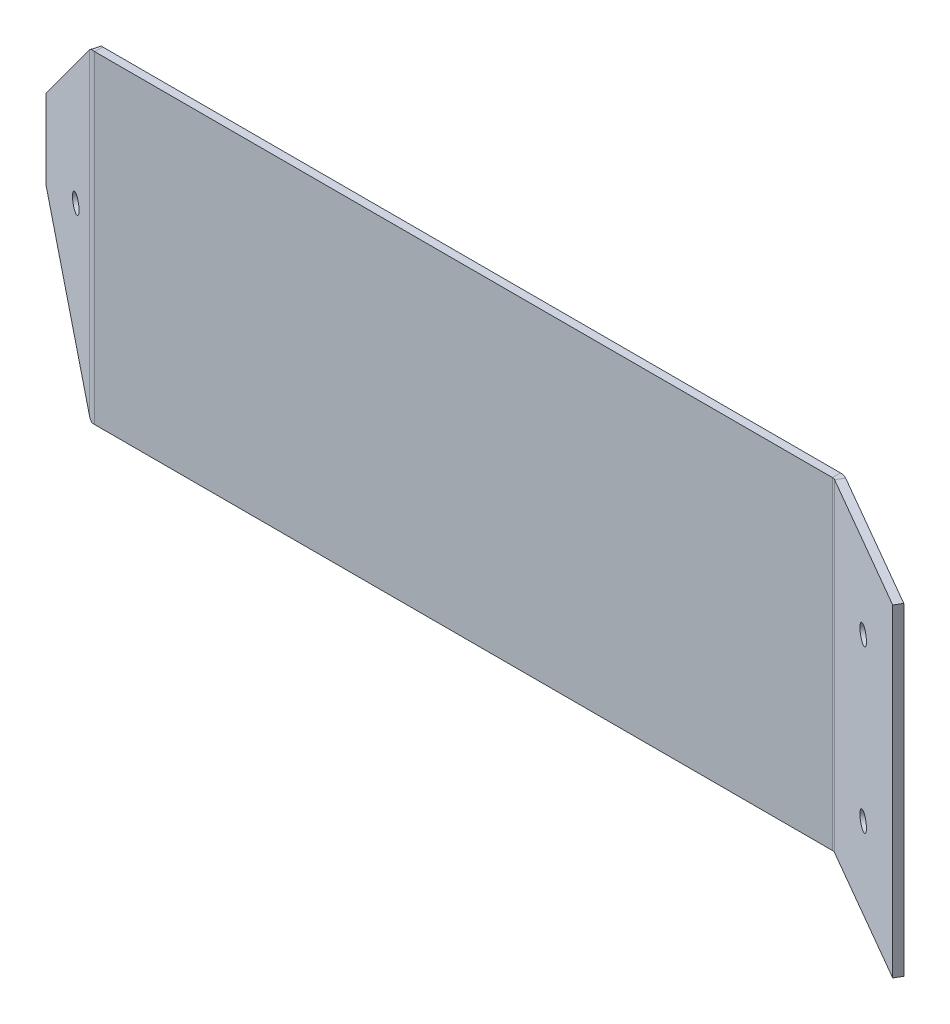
ISO-10303-21;
HEADER;
FILE_DESCRIPTION(('STEP AP214'),'2;1');
FILE_NAME('part.step','',(''),(''),'','','');
FILE_SCHEMA(('AUTOMOTIVE_DESIGN { 1 0 10303 214 1 1 1 1 }'));
ENDSEC;
DATA;
#1=APPLICATION_CONTEXT('core data for automotive mechanical design processes');
#2=APPLICATION_PROTOCOL_DEFINITION('international standard','automotive_design',2000,#1);
#3=PRODUCT_CONTEXT('',#1,'mechanical');
#4=PRODUCT('Part','Part','',(#3));
#5=PRODUCT_RELATED_PRODUCT_CATEGORY('part','',(#4));
#6=PRODUCT_DEFINITION_FORMATION('','',#4);
#7=PRODUCT_DEFINITION_CONTEXT('part definition',#1,'design');
#8=PRODUCT_DEFINITION('design','',#6,#7);
#9=PRODUCT_DEFINITION_SHAPE('','',#8);
#10=(LENGTH_UNIT() NAMED_UNIT(*) SI_UNIT(.MILLI.,.METRE.));
#11=(NAMED_UNIT(*) PLANE_ANGLE_UNIT() SI_UNIT($,.RADIAN.));
#12=(NAMED_UNIT(*) SI_UNIT($,.STERADIAN.) SOLID_ANGLE_UNIT());
#13=UNCERTAINTY_MEASURE_WITH_UNIT(LENGTH_MEASURE(1.E-05),#10,'distance_accuracy_value','');
#14=(GEOMETRIC_REPRESENTATION_CONTEXT(3) GLOBAL_UNCERTAINTY_ASSIGNED_CONTEXT((#13)) GLOBAL_UNIT_ASSIGNED_CONTEXT((#10,
#11,#12)) REPRESENTATION_CONTEXT('',''));
#15=CARTESIAN_POINT('',(0.,0.,0.));
#16=DIRECTION('',(0.,0.,1.));
#17=DIRECTION('',(1.,0.,0.));
#18=AXIS2_PLACEMENT_3D('',#15,#16,#17);
#19=CARTESIAN_POINT('',(-150.,-19.9999999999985,1.));
#20=DIRECTION('',(0.,1.,0.));
#21=DIRECTION('',(-1.,0.,0.));
#22=AXIS2_PLACEMENT_3D('',#19,#20,#21);
#23=PLANE('',#22);
#24=DIRECTION('',(1.,0.,0.));
#25=VECTOR('',#24,1.);
#26=CARTESIAN_POINT('',(-150.,-19.9999999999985,1.));
#27=LINE('',#26,#25);
#28=CARTESIAN_POINT('',(-149.676258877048,-19.9999999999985,1.00000010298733));
#29=VERTEX_POINT('',#28);
#30=CARTESIAN_POINT('',(-58.3237411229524,-19.9999999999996,1.));
#31=VERTEX_POINT('',#30);
#32=EDGE_CURVE('E343',#29,#31,#27,.T.);
#33=ORIENTED_EDGE('',*,*,#32,.F.);
#34=DIRECTION('',(0.,0.,-1.));
#35=VECTOR('',#34,1.);
#36=CARTESIAN_POINT('',(-149.676258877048,-19.9999999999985,1.));
#37=LINE('',#36,#35);
#38=CARTESIAN_POINT('',(-149.676258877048,-19.9999999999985,0.));
#39=VERTEX_POINT('',#38);
#40=EDGE_CURVE('E12',#29,#39,#37,.T.);
#41=ORIENTED_EDGE('',*,*,#40,.T.);
#42=DIRECTION('',(1.,0.,0.));
#43=VECTOR('',#42,1.);
#44=CARTESIAN_POINT('',(-150.,-19.9999999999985,0.));
#45=LINE('',#44,#43);
#46=CARTESIAN_POINT('',(-58.3237411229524,-19.9999999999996,0.));
#47=VERTEX_POINT('',#46);
#48=EDGE_CURVE('E356',#39,#47,#45,.T.);
#49=ORIENTED_EDGE('',*,*,#48,.T.);
#50=DIRECTION('',(0.,0.,-1.));
#51=VECTOR('',#50,1.);
#52=CARTESIAN_POINT('',(-58.3237411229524,-19.9999999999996,1.));
#53=LINE('',#52,#51);
#54=EDGE_CURVE('E338',#31,#47,#53,.T.);
#55=ORIENTED_EDGE('',*,*,#54,.F.);
#56=EDGE_LOOP('',(#33,#41,#49,#55));
#57=FACE_BOUND('',#56,.T.);
#58=ADVANCED_FACE('F50',(#57),#23,.F.);
#59=CARTESIAN_POINT('',(-38.,20.0000000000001,0.));
#60=DIRECTION('',(0.,0.,1.));
#61=DIRECTION('',(1.,0.,0.));
#62=AXIS2_PLACEMENT_3D('',#59,#60,#61);
#63=PLANE('',#62);
#64=ORIENTED_EDGE('',*,*,#48,.F.);
#65=DIRECTION('',(0.,1.,0.));
#66=VECTOR('',#65,1.);
#67=CARTESIAN_POINT('',(-149.676258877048,20.0000000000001,0.));
#68=LINE('',#67,#66);
#69=CARTESIAN_POINT('',(-149.676258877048,20.0000000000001,1.04772340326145E-07));
#70=VERTEX_POINT('',#69);
#71=EDGE_CURVE('E61',#39,#70,#68,.T.);
#72=ORIENTED_EDGE('',*,*,#71,.T.);
#73=DIRECTION('',(-1.,0.,0.));
#74=VECTOR('',#73,1.);
#75=CARTESIAN_POINT('',(-150.,20.0000000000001,0.));
#76=LINE('',#75,#74);
#77=CARTESIAN_POINT('',(-58.3237411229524,20.0000000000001,0.));
#78=VERTEX_POINT('',#77);
#79=EDGE_CURVE('E402',#78,#70,#76,.T.);
#80=ORIENTED_EDGE('',*,*,#79,.F.);
#81=DIRECTION('',(0.,1.,0.));
#82=VECTOR('',#81,1.);
#83=CARTESIAN_POINT('',(-58.3237411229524,20.0000000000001,0.));
#84=LINE('',#83,#82);
#85=EDGE_CURVE('E347',#47,#78,#84,.T.);
#86=ORIENTED_EDGE('',*,*,#85,.F.);
#87=EDGE_LOOP('',(#64,#72,#80,#86));
#88=FACE_BOUND('',#87,.T.);
#89=ADVANCED_FACE('F52',(#88),#63,.F.);
#90=CARTESIAN_POINT('',(-150.,20.0000000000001,1.));
#91=DIRECTION('',(0.,-1.,0.));
#92=DIRECTION('',(1.,0.,0.));
#93=AXIS2_PLACEMENT_3D('',#90,#91,#92);
#94=PLANE('',#93);
#95=ORIENTED_EDGE('',*,*,#79,.T.);
#96=DIRECTION('',(0.,0.,1.));
#97=VECTOR('',#96,1.);
#98=CARTESIAN_POINT('',(-149.676258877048,20.0000000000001,1.));
#99=LINE('',#98,#97);
#100=CARTESIAN_POINT('',(-149.676258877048,20.0000000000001,1.00000010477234));
#101=VERTEX_POINT('',#100);
#102=EDGE_CURVE('E396',#70,#101,#99,.T.);
#103=ORIENTED_EDGE('',*,*,#102,.T.);
#104=DIRECTION('',(-1.,0.,0.));
#105=VECTOR('',#104,1.);
#106=CARTESIAN_POINT('',(-150.,20.0000000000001,1.));
#107=LINE('',#106,#105);
#108=CARTESIAN_POINT('',(-58.3237411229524,20.0000000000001,1.00000004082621));
#109=VERTEX_POINT('',#108);
#110=EDGE_CURVE('E342',#109,#101,#107,.T.);
#111=ORIENTED_EDGE('',*,*,#110,.F.);
#112=DIRECTION('',(0.,0.,1.));
#113=VECTOR('',#112,1.);
#114=CARTESIAN_POINT('',(-58.3237411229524,20.0000000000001,1.));
#115=LINE('',#114,#113);
#116=EDGE_CURVE('E344',#78,#109,#115,.T.);
#117=ORIENTED_EDGE('',*,*,#116,.F.);
#118=EDGE_LOOP('',(#95,#103,#111,#117));
#119=FACE_BOUND('',#118,.T.);
#120=ADVANCED_FACE('F451',(#119),#94,.F.);
#121=CARTESIAN_POINT('',(-40.4153010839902,20.0000000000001,10.0707897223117));
#122=DIRECTION('',(-0.500000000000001,0.,0.866025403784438));
#123=DIRECTION('',(0.866025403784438,0.,0.500000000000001));
#124=AXIS2_PLACEMENT_3D('',#121,#122,#123);
#125=PLANE('',#124);
#126=CARTESIAN_POINT('',(-49.0755551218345,10.0000000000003,5.07078972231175));
#127=DIRECTION('',(-0.500000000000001,0.,0.866025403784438));
#128=DIRECTION('',(0.866025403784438,0.,0.500000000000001));
#129=AXIS2_PLACEMENT_3D('',#126,#127,#128);
#130=CIRCLE('',#129,1.1);
#131=CARTESIAN_POINT('',(-48.1229271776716,10.0000000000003,5.62078972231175));
#132=VERTEX_POINT('',#131);
#133=EDGE_CURVE('E362',#132,#132,#130,.T.);
#134=ORIENTED_EDGE('',*,*,#133,.T.);
#135=EDGE_LOOP('',(#134));
#136=FACE_BOUND('',#135,.T.);
#137=CARTESIAN_POINT('',(-49.0755551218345,-9.99999999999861,5.07078972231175));
#138=DIRECTION('',(-0.500000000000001,0.,0.866025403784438));
#139=DIRECTION('',(-0.866025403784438,0.,-0.500000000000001));
#140=AXIS2_PLACEMENT_3D('',#137,#138,#139);
#141=CIRCLE('',#140,1.10000000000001);
#142=CARTESIAN_POINT('',(-50.0281830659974,-9.99999999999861,4.52078972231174));
#143=VERTEX_POINT('',#142);
#144=EDGE_CURVE('E355',#143,#143,#141,.T.);
#145=ORIENTED_EDGE('',*,*,#144,.T.);
#146=EDGE_LOOP('',(#145));
#147=FACE_BOUND('',#146,.T.);
#148=DIRECTION('',(0.866025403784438,0.,0.500000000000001));
#149=VECTOR('',#148,1.);
#150=CARTESIAN_POINT('',(-137.410146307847,-19.9999999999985,-45.9292102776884));
#151=LINE('',#150,#149);
#152=CARTESIAN_POINT('',(-57.4554411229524,-19.9999999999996,0.232660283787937));
#153=VERTEX_POINT('',#152);
#154=CARTESIAN_POINT('',(-40.4153010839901,-19.9999999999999,10.0707897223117));
#155=VERTEX_POINT('',#154);
#156=EDGE_CURVE('E77',#153,#155,#151,.T.);
#157=ORIENTED_EDGE('',*,*,#156,.F.);
#158=DIRECTION('',(0.,1.,0.));
#159=VECTOR('',#158,1.);
#160=CARTESIAN_POINT('',(-57.4554411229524,20.0000000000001,0.232660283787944));
#161=LINE('',#160,#159);
#162=CARTESIAN_POINT('',(-57.4554411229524,20.0000000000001,0.232660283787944));
#163=VERTEX_POINT('',#162);
#164=EDGE_CURVE('E385',#153,#163,#161,.T.);
#165=ORIENTED_EDGE('',*,*,#164,.T.);
#166=DIRECTION('',(-0.866025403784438,0.,-0.500000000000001));
#167=VECTOR('',#166,1.);
#168=CARTESIAN_POINT('',(-137.410146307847,20.0000000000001,-45.9292102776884));
#169=LINE('',#168,#167);
#170=CARTESIAN_POINT('',(-40.4153010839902,20.0000000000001,10.0707897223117));
#171=VERTEX_POINT('',#170);
#172=EDGE_CURVE('E368',#171,#163,#169,.T.);
#173=ORIENTED_EDGE('',*,*,#172,.F.);
#174=DIRECTION('',(0.,1.,0.));
#175=VECTOR('',#174,1.);
#176=CARTESIAN_POINT('',(-40.4153010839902,20.0000000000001,10.0707897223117));
#177=LINE('',#176,#175);
#178=EDGE_CURVE('E365',#155,#171,#177,.T.);
#179=ORIENTED_EDGE('',*,*,#178,.F.);
#180=EDGE_LOOP('',(#157,#165,#173,#179));
#181=FACE_BOUND('',#180,.T.);
#182=ADVANCED_FACE('F493',(#136,#147,#181),#125,.F.);
#183=CARTESIAN_POINT('',(-137.910146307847,-19.9999999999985,-45.063184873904));
#184=DIRECTION('',(0.,1.,0.));
#185=DIRECTION('',(-0.866025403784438,0.,-0.500000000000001));
#186=AXIS2_PLACEMENT_3D('',#183,#184,#185);
#187=PLANE('',#186);
#188=DIRECTION('',(0.866025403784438,0.,0.500000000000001));
#189=VECTOR('',#188,1.);
#190=CARTESIAN_POINT('',(-137.910146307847,-19.9999999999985,-45.063184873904));
#191=LINE('',#190,#189);
#192=CARTESIAN_POINT('',(-57.9554411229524,-19.9999999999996,1.09868568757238));
#193=VERTEX_POINT('',#192);
#194=CARTESIAN_POINT('',(-40.9153010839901,-19.9999999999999,10.9368151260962));
#195=VERTEX_POINT('',#194);
#196=EDGE_CURVE('E377',#193,#195,#191,.T.);
#197=ORIENTED_EDGE('',*,*,#196,.F.);
#198=DIRECTION('',(0.500000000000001,0.,-0.866025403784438));
#199=VECTOR('',#198,1.);
#200=CARTESIAN_POINT('',(-57.9554411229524,-19.9999999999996,1.09868568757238));
#201=LINE('',#200,#199);
#202=EDGE_CURVE('E387',#193,#153,#201,.T.);
#203=ORIENTED_EDGE('',*,*,#202,.T.);
#204=ORIENTED_EDGE('',*,*,#156,.T.);
#205=DIRECTION('',(0.500000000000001,0.,-0.866025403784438));
#206=VECTOR('',#205,1.);
#207=CARTESIAN_POINT('',(-40.9153010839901,-19.9999999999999,10.9368151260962));
#208=LINE('',#207,#206);
#209=EDGE_CURVE('E373',#195,#155,#208,.T.);
#210=ORIENTED_EDGE('',*,*,#209,.F.);
#211=EDGE_LOOP('',(#197,#203,#204,#210));
#212=FACE_BOUND('',#211,.T.);
#213=ADVANCED_FACE('F488',(#212),#187,.F.);
#214=CARTESIAN_POINT('',(-137.910146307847,20.0000000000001,-45.0631848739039));
#215=DIRECTION('',(0.,-1.,0.));
#216=DIRECTION('',(0.866025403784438,0.,0.500000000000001));
#217=AXIS2_PLACEMENT_3D('',#214,#215,#216);
#218=PLANE('',#217);
#219=ORIENTED_EDGE('',*,*,#172,.T.);
#220=DIRECTION('',(-0.500000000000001,0.,0.866025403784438));
#221=VECTOR('',#220,1.);
#222=CARTESIAN_POINT('',(-57.9554411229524,20.0000000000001,1.09868568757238));
#223=LINE('',#222,#221);
#224=CARTESIAN_POINT('',(-57.9554411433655,20.0000000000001,1.09868572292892));
#225=VERTEX_POINT('',#224);
#226=EDGE_CURVE('E383',#163,#225,#223,.T.);
#227=ORIENTED_EDGE('',*,*,#226,.T.);
#228=DIRECTION('',(-0.866025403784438,0.,-0.500000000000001));
#229=VECTOR('',#228,1.);
#230=CARTESIAN_POINT('',(-137.910146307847,20.0000000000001,-45.0631848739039));
#231=LINE('',#230,#229);
#232=CARTESIAN_POINT('',(-40.9153010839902,20.0000000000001,10.9368151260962));
#233=VERTEX_POINT('',#232);
#234=EDGE_CURVE('E372',#233,#225,#231,.T.);
#235=ORIENTED_EDGE('',*,*,#234,.F.);
#236=DIRECTION('',(0.500000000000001,0.,-0.866025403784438));
#237=VECTOR('',#236,1.);
#238=CARTESIAN_POINT('',(-40.9153010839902,20.0000000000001,10.9368151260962));
#239=LINE('',#238,#237);
#240=EDGE_CURVE('E376',#233,#171,#239,.T.);
#241=ORIENTED_EDGE('',*,*,#240,.T.);
#242=EDGE_LOOP('',(#219,#227,#235,#241));
#243=FACE_BOUND('',#242,.T.);
#244=ADVANCED_FACE('F496',(#243),#218,.F.);
#245=CARTESIAN_POINT('',(-40.9153010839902,20.0000000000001,10.9368151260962));
#246=DIRECTION('',(-0.866025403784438,0.,-0.500000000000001));
#247=DIRECTION('',(0.,-1.,0.));
#248=AXIS2_PLACEMENT_3D('',#245,#246,#247);
#249=PLANE('',#248);
#250=ORIENTED_EDGE('',*,*,#178,.T.);
#251=ORIENTED_EDGE('',*,*,#240,.F.);
#252=DIRECTION('',(0.,1.,0.));
#253=VECTOR('',#252,1.);
#254=CARTESIAN_POINT('',(-40.9153010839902,20.0000000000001,10.9368151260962));
#255=LINE('',#254,#253);
#256=EDGE_CURVE('E369',#195,#233,#255,.T.);
#257=ORIENTED_EDGE('',*,*,#256,.F.);
#258=ORIENTED_EDGE('',*,*,#209,.T.);
#259=EDGE_LOOP('',(#250,#251,#257,#258));
#260=FACE_BOUND('',#259,.T.);
#261=ADVANCED_FACE('F503',(#260),#249,.F.);
#262=CARTESIAN_POINT('',(-40.9153010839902,20.0000000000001,10.9368151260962));
#263=DIRECTION('',(-0.500000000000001,0.,0.866025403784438));
#264=DIRECTION('',(0.866025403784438,0.,0.500000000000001));
#265=AXIS2_PLACEMENT_3D('',#262,#263,#264);
#266=PLANE('',#265);
#267=DIRECTION('',(0.,1.,0.));
#268=VECTOR('',#267,1.);
#269=CARTESIAN_POINT('',(-57.9554411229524,20.0000000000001,1.09868568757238));
#270=LINE('',#269,#268);
#271=EDGE_CURVE('E380',#193,#225,#270,.T.);
#272=ORIENTED_EDGE('',*,*,#271,.F.);
#273=ORIENTED_EDGE('',*,*,#196,.T.);
#274=ORIENTED_EDGE('',*,*,#256,.T.);
#275=ORIENTED_EDGE('',*,*,#234,.T.);
#276=EDGE_LOOP('',(#272,#273,#274,#275));
#277=FACE_BOUND('',#276,.T.);
#278=CARTESIAN_POINT('',(-49.5755551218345,-9.99999999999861,5.93681512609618));
#279=DIRECTION('',(-0.500000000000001,0.,0.866025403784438));
#280=DIRECTION('',(-0.866025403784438,0.,-0.500000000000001));
#281=AXIS2_PLACEMENT_3D('',#278,#279,#280);
#282=CIRCLE('',#281,1.10000000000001);
#283=CARTESIAN_POINT('',(-50.5281830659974,-9.99999999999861,5.38681512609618));
#284=VERTEX_POINT('',#283);
#285=EDGE_CURVE('E352',#284,#284,#282,.T.);
#286=ORIENTED_EDGE('',*,*,#285,.F.);
#287=EDGE_LOOP('',(#286));
#288=FACE_BOUND('',#287,.T.);
#289=CARTESIAN_POINT('',(-49.5755551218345,10.0000000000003,5.93681512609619));
#290=DIRECTION('',(-0.500000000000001,0.,0.866025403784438));
#291=DIRECTION('',(0.866025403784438,0.,0.500000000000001));
#292=AXIS2_PLACEMENT_3D('',#289,#290,#291);
#293=CIRCLE('',#292,1.1);
#294=CARTESIAN_POINT('',(-48.6229271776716,10.0000000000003,6.48681512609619));
#295=VERTEX_POINT('',#294);
#296=EDGE_CURVE('E359',#295,#295,#293,.T.);
#297=ORIENTED_EDGE('',*,*,#296,.F.);
#298=EDGE_LOOP('',(#297));
#299=FACE_BOUND('',#298,.T.);
#300=ADVANCED_FACE('F498',(#277,#288,#299),#266,.T.);
#301=CARTESIAN_POINT('',(-49.0755551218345,10.0000000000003,5.07078972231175));
#302=DIRECTION('',(-0.500000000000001,0.,0.866025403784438));
#303=DIRECTION('',(0.866025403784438,0.,0.500000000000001));
#304=AXIS2_PLACEMENT_3D('',#301,#302,#303);
#305=CYLINDRICAL_SURFACE('',#304,1.1);
#306=ORIENTED_EDGE('',*,*,#133,.F.);
#307=EDGE_LOOP('',(#306));
#308=FACE_BOUND('',#307,.T.);
#309=ORIENTED_EDGE('',*,*,#296,.T.);
#310=EDGE_LOOP('',(#309));
#311=FACE_BOUND('',#310,.T.);
#312=ADVANCED_FACE('F471',(#308,#311),#305,.F.);
#313=CARTESIAN_POINT('',(-49.0755551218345,-9.99999999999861,5.07078972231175));
#314=DIRECTION('',(-0.500000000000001,0.,0.866025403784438));
#315=DIRECTION('',(0.866025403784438,0.,0.500000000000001));
#316=AXIS2_PLACEMENT_3D('',#313,#314,#315);
#317=CYLINDRICAL_SURFACE('',#316,1.10000000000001);
#318=ORIENTED_EDGE('',*,*,#144,.F.);
#319=EDGE_LOOP('',(#318));
#320=FACE_BOUND('',#319,.T.);
#321=ORIENTED_EDGE('',*,*,#285,.T.);
#322=EDGE_LOOP('',(#321));
#323=FACE_BOUND('',#322,.T.);
#324=ADVANCED_FACE('F459',(#320,#323),#317,.F.);
#325=CARTESIAN_POINT('',(-38.,20.0000000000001,1.));
#326=DIRECTION('',(0.,0.,1.));
#327=DIRECTION('',(1.,0.,0.));
#328=AXIS2_PLACEMENT_3D('',#325,#326,#327);
#329=PLANE('',#328);
#330=DIRECTION('',(0.,1.,0.));
#331=VECTOR('',#330,1.);
#332=CARTESIAN_POINT('',(-149.676258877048,20.0000000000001,1.));
#333=LINE('',#332,#331);
#334=EDGE_CURVE('E389',#29,#101,#333,.T.);
#335=ORIENTED_EDGE('',*,*,#334,.F.);
#336=ORIENTED_EDGE('',*,*,#32,.T.);
#337=DIRECTION('',(0.,1.,0.));
#338=VECTOR('',#337,1.);
#339=CARTESIAN_POINT('',(-58.3237411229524,20.0000000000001,1.));
#340=LINE('',#339,#338);
#341=EDGE_CURVE('E339',#31,#109,#340,.T.);
#342=ORIENTED_EDGE('',*,*,#341,.T.);
#343=ORIENTED_EDGE('',*,*,#110,.T.);
#344=EDGE_LOOP('',(#335,#336,#342,#343));
#345=FACE_BOUND('',#344,.T.);
#346=ADVANCED_FACE('F456',(#345),#329,.T.);
#347=CARTESIAN_POINT('',(-58.3237411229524,-19.9999999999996,1.73659995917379));
#348=DIRECTION('',(0.,1.,0.));
#349=DIRECTION('',(0.,0.,1.));
#350=AXIS2_PLACEMENT_3D('',#347,#348,#349);
#351=PLANE('',#350);
#352=ORIENTED_EDGE('',*,*,#54,.T.);
#353=CARTESIAN_POINT('',(-58.3237411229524,-19.9999999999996,1.7366));
#354=DIRECTION('',(0.,1.,0.));
#355=DIRECTION('',(-1.,0.,0.));
#356=AXIS2_PLACEMENT_3D('',#353,#354,#355);
#357=CIRCLE('',#356,1.73659995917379);
#358=EDGE_CURVE('E320',#47,#153,#357,.F.);
#359=ORIENTED_EDGE('',*,*,#358,.T.);
#360=ORIENTED_EDGE('',*,*,#202,.F.);
#361=CARTESIAN_POINT('',(-58.3237411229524,-19.9999999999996,1.73659995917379));
#362=DIRECTION('',(0.,-1.,0.));
#363=DIRECTION('',(0.,0.,-1.));
#364=AXIS2_PLACEMENT_3D('',#361,#362,#363);
#365=CIRCLE('',#364,0.736599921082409);
#366=EDGE_CURVE('E332',#31,#193,#365,.T.);
#367=ORIENTED_EDGE('',*,*,#366,.F.);
#368=EDGE_LOOP('',(#352,#359,#360,#367));
#369=FACE_BOUND('',#368,.T.);
#370=ADVANCED_FACE('F458',(#369),#351,.F.);
#371=CARTESIAN_POINT('',(-58.3237411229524,20.0000000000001,1.73659995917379));
#372=DIRECTION('',(0.,-1.,0.));
#373=DIRECTION('',(0.,0.,-1.));
#374=AXIS2_PLACEMENT_3D('',#371,#372,#373);
#375=PLANE('',#374);
#376=CARTESIAN_POINT('',(-58.3237411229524,20.0000000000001,1.7366));
#377=DIRECTION('',(0.,1.,0.));
#378=DIRECTION('',(-1.,0.,0.));
#379=AXIS2_PLACEMENT_3D('',#376,#377,#378);
#380=CIRCLE('',#379,1.73659995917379);
#381=EDGE_CURVE('E328',#163,#78,#380,.T.);
#382=ORIENTED_EDGE('',*,*,#381,.T.);
#383=ORIENTED_EDGE('',*,*,#116,.T.);
#384=CARTESIAN_POINT('',(-58.3237411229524,20.0000000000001,1.73659995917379));
#385=DIRECTION('',(0.,1.,0.));
#386=DIRECTION('',(0.,0.,1.));
#387=AXIS2_PLACEMENT_3D('',#384,#385,#386);
#388=CIRCLE('',#387,0.736599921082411);
#389=EDGE_CURVE('E335',#225,#109,#388,.T.);
#390=ORIENTED_EDGE('',*,*,#389,.F.);
#391=ORIENTED_EDGE('',*,*,#226,.F.);
#392=EDGE_LOOP('',(#382,#383,#390,#391));
#393=FACE_BOUND('',#392,.T.);
#394=ADVANCED_FACE('F466',(#393),#375,.F.);
#395=CARTESIAN_POINT('',(-58.3237411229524,-40.0177364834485,1.7366));
#396=DIRECTION('',(0.,1.,0.));
#397=DIRECTION('',(-1.,0.,0.));
#398=AXIS2_PLACEMENT_3D('',#395,#396,#397);
#399=CYLINDRICAL_SURFACE('',#398,0.736599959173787);
#400=ORIENTED_EDGE('',*,*,#271,.T.);
#401=ORIENTED_EDGE('',*,*,#389,.T.);
#402=ORIENTED_EDGE('',*,*,#341,.F.);
#403=ORIENTED_EDGE('',*,*,#366,.T.);
#404=EDGE_LOOP('',(#400,#401,#402,#403));
#405=FACE_BOUND('',#404,.T.);
#406=ADVANCED_FACE('F469',(#405),#399,.F.);
#407=CARTESIAN_POINT('',(-58.3237411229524,-40.0177364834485,1.7366));
#408=DIRECTION('',(0.,1.,0.));
#409=DIRECTION('',(-1.,0.,0.));
#410=AXIS2_PLACEMENT_3D('',#407,#408,#409);
#411=CYLINDRICAL_SURFACE('',#410,1.73659995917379);
#412=ORIENTED_EDGE('',*,*,#164,.F.);
#413=ORIENTED_EDGE('',*,*,#358,.F.);
#414=ORIENTED_EDGE('',*,*,#85,.T.);
#415=ORIENTED_EDGE('',*,*,#381,.F.);
#416=EDGE_LOOP('',(#412,#413,#414,#415));
#417=FACE_BOUND('',#416,.T.);
#418=ADVANCED_FACE('F280',(#417),#411,.T.);
#419=CARTESIAN_POINT('',(-150.544558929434,-19.6762588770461,0.767339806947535));
#420=CARTESIAN_POINT('',(-150.413303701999,-19.784182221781,0.843120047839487));
#421=CARTESIAN_POINT('',(-150.27212024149,-19.8920766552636,0.901600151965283));
#422=CARTESIAN_POINT('',(-150.12572405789,-19.9999999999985,0.940826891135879));
#423=CARTESIAN_POINT('',(-150.044558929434,-19.6762588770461,-0.0986855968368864));
#424=CARTESIAN_POINT('',(-149.988888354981,-19.7841765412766,-0.0665441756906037));
#425=CARTESIAN_POINT('',(-149.928997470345,-19.892082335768,-0.0417365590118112));
#426=CARTESIAN_POINT('',(-149.866905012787,-19.9999999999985,-0.0250989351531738));
#427=B_SPLINE_SURFACE_WITH_KNOTS('',1,3,((#419,#420,#421,#422),(#423,#424,#425,#426)),
.UNSPECIFIED.,.F.,.F.,.F.,(2,2),(4,4),(0.,1.),(0.,1.),.UNSPECIFIED.);
#428=CARTESIAN_POINT('',(-150.544558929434,-19.6762588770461,0.767339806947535));
#429=CARTESIAN_POINT('',(-150.044558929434,-19.6762588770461,-0.0986855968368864));
#430=B_SPLINE_CURVE_WITH_KNOTS('',1,(#428,#429),.UNSPECIFIED.,.F.,.F.,(2,2),(0.,1.),.UNSPECIFIED.);
#431=CARTESIAN_POINT('',(-150.544558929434,-19.6762588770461,0.76733980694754));
#432=VERTEX_POINT('',#431);
#433=CARTESIAN_POINT('',(-150.044558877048,-19.6762588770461,-0.098685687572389));
#434=VERTEX_POINT('',#433);
#435=EDGE_CURVE('E695',#432,#434,#430,.T.);
#436=CARTESIAN_POINT('',(-150.044558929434,-19.6762588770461,-0.0986855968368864));
#437=CARTESIAN_POINT('',(-149.988888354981,-19.7841765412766,-0.0665441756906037));
#438=CARTESIAN_POINT('',(-149.928997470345,-19.892082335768,-0.0417365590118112));
#439=CARTESIAN_POINT('',(-149.866905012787,-19.9999999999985,-0.0250989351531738));
#440=B_SPLINE_CURVE_WITH_KNOTS('',3,(#436,#437,#438,#439),.UNSPECIFIED.,.F.,.F.,(4,4),(0.,1.),.UNSPECIFIED.);
#441=CARTESIAN_POINT('',(-149.866905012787,-19.9999999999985,-0.025098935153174));
#442=VERTEX_POINT('',#441);
#443=EDGE_CURVE('E189',#434,#442,#440,.T.);
#444=CARTESIAN_POINT('',(-149.866905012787,-19.9999999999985,-0.0250989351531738));
#445=CARTESIAN_POINT('',(-150.12572405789,-19.9999999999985,0.940826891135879));
#446=B_SPLINE_CURVE_WITH_KNOTS('',1,(#444,#445),.UNSPECIFIED.,.F.,.F.,(2,2),(0.,1.),.UNSPECIFIED.);
#447=CARTESIAN_POINT('',(-150.12572405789,-19.9999999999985,0.940826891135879));
#448=VERTEX_POINT('',#447);
#449=EDGE_CURVE('E329',#442,#448,#446,.T.);
#450=CARTESIAN_POINT('',(-150.12572405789,-19.9999999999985,0.940826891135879));
#451=CARTESIAN_POINT('',(-150.27212024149,-19.8920766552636,0.901600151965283));
#452=CARTESIAN_POINT('',(-150.413303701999,-19.784182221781,0.843120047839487));
#453=CARTESIAN_POINT('',(-150.544558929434,-19.6762588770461,0.767339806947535));
#454=B_SPLINE_CURVE_WITH_KNOTS('',3,(#450,#451,#452,#453),.UNSPECIFIED.,.F.,.F.,(4,4),(0.,1.),.UNSPECIFIED.);
#455=EDGE_CURVE('E690',#432,#448,#454,.F.);
#456=ORIENTED_EDGE('',*,*,#435,.T.);
#457=ORIENTED_EDGE('',*,*,#443,.T.);
#458=ORIENTED_EDGE('',*,*,#449,.T.);
#459=ORIENTED_EDGE('',*,*,#455,.F.);
#460=EDGE_LOOP('',(#456,#457,#458,#459));
#461=FACE_BOUND('',#460,.T.);
#462=ADVANCED_FACE('F276',(#461),#427,.T.);
#463=CARTESIAN_POINT('',(-149.676258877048,-19.9999999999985,-0.73660010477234));
#464=DIRECTION('',(0.,-1.,0.));
#465=DIRECTION('',(0.,0.,-1.));
#466=AXIS2_PLACEMENT_3D('',#463,#464,#465);
#467=PLANE('',#466);
#468=ORIENTED_EDGE('',*,*,#449,.F.);
#469=CARTESIAN_POINT('',(-149.676258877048,-19.9999999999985,-0.7366));
#470=DIRECTION('',(0.,-1.,0.));
#471=DIRECTION('',(0.,0.,-1.));
#472=AXIS2_PLACEMENT_3D('',#469,#470,#471);
#473=CIRCLE('',#472,0.73660010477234);
#474=EDGE_CURVE('E69',#442,#39,#473,.F.);
#475=ORIENTED_EDGE('',*,*,#474,.T.);
#476=ORIENTED_EDGE('',*,*,#40,.F.);
#477=CARTESIAN_POINT('',(-149.676258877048,-19.9999999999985,-0.73660010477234));
#478=DIRECTION('',(0.,1.,0.));
#479=DIRECTION('',(0.,0.,1.));
#480=AXIS2_PLACEMENT_3D('',#477,#478,#479);
#481=CIRCLE('',#480,1.73660020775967);
#482=EDGE_CURVE('E196',#448,#29,#481,.T.);
#483=ORIENTED_EDGE('',*,*,#482,.F.);
#484=EDGE_LOOP('',(#468,#475,#476,#483));
#485=FACE_BOUND('',#484,.T.);
#486=ADVANCED_FACE('F634',(#485),#467,.T.);
#487=CARTESIAN_POINT('',(-149.676258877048,20.0000000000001,-0.73660010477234));
#488=DIRECTION('',(0.,1.,0.));
#489=DIRECTION('',(0.,0.,1.));
#490=AXIS2_PLACEMENT_3D('',#487,#488,#489);
#491=PLANE('',#490);
#492=ORIENTED_EDGE('',*,*,#102,.F.);
#493=CARTESIAN_POINT('',(-149.676258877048,20.0000000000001,-0.7366));
#494=DIRECTION('',(0.,-1.,0.));
#495=DIRECTION('',(0.,0.,-1.));
#496=AXIS2_PLACEMENT_3D('',#493,#494,#495);
#497=CIRCLE('',#496,0.73660010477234);
#498=CARTESIAN_POINT('',(-149.866905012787,20.0000000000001,-0.0250989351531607));
#499=VERTEX_POINT('',#498);
#500=EDGE_CURVE('E188',#70,#499,#497,.T.);
#501=ORIENTED_EDGE('',*,*,#500,.T.);
#502=CARTESIAN_POINT('',(-150.12572405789,20.0000000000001,0.940826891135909));
#503=CARTESIAN_POINT('',(-149.866905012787,20.0000000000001,-0.0250989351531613));
#504=B_SPLINE_CURVE_WITH_KNOTS('',1,(#502,#503),.UNSPECIFIED.,.F.,.F.,(2,2),(0.,1.),.UNSPECIFIED.);
#505=CARTESIAN_POINT('',(-150.125724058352,20.0000000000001,0.940826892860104));
#506=VERTEX_POINT('',#505);
#507=EDGE_CURVE('E308',#499,#506,#504,.F.);
#508=ORIENTED_EDGE('',*,*,#507,.T.);
#509=CARTESIAN_POINT('',(-149.676258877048,20.0000000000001,-0.73660010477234));
#510=DIRECTION('',(0.,-1.,0.));
#511=DIRECTION('',(0.,0.,-1.));
#512=AXIS2_PLACEMENT_3D('',#509,#510,#511);
#513=CIRCLE('',#512,1.73660020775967);
#514=EDGE_CURVE('E237',#101,#506,#513,.T.);
#515=ORIENTED_EDGE('',*,*,#514,.F.);
#516=EDGE_LOOP('',(#492,#501,#508,#515));
#517=FACE_BOUND('',#516,.T.);
#518=ADVANCED_FACE('F212',(#517),#491,.T.);
#519=CARTESIAN_POINT('',(-150.12572405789,20.0000000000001,0.940826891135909));
#520=CARTESIAN_POINT('',(-150.27212024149,19.8920766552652,0.901600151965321));
#521=CARTESIAN_POINT('',(-150.413303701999,19.7841822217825,0.843120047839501));
#522=CARTESIAN_POINT('',(-150.544558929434,19.6762588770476,0.767339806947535));
#523=CARTESIAN_POINT('',(-149.866905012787,20.0000000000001,-0.0250989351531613));
#524=CARTESIAN_POINT('',(-149.928997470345,19.8920823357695,-0.0417365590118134));
#525=CARTESIAN_POINT('',(-149.988888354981,19.7841765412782,-0.0665441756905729));
#526=CARTESIAN_POINT('',(-150.044558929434,19.6762588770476,-0.0986855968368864));
#527=B_SPLINE_SURFACE_WITH_KNOTS('',1,3,((#519,#520,#521,#522),(#523,#524,#525,#526)),
.UNSPECIFIED.,.F.,.F.,.F.,(2,2),(4,4),(0.,1.),(0.,1.),.UNSPECIFIED.);
#528=CARTESIAN_POINT('',(-149.866905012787,20.0000000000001,-0.0250989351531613));
#529=CARTESIAN_POINT('',(-149.928997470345,19.8920823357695,-0.0417365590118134));
#530=CARTESIAN_POINT('',(-149.988888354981,19.7841765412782,-0.0665441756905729));
#531=CARTESIAN_POINT('',(-150.044558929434,19.6762588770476,-0.0986855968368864));
#532=B_SPLINE_CURVE_WITH_KNOTS('',3,(#528,#529,#530,#531),.UNSPECIFIED.,.F.,.F.,(4,4),(0.,1.),.UNSPECIFIED.);
#533=CARTESIAN_POINT('',(-150.044558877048,19.6762588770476,-0.098685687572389));
#534=VERTEX_POINT('',#533);
#535=EDGE_CURVE('E246',#499,#534,#532,.T.);
#536=CARTESIAN_POINT('',(-150.044558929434,19.6762588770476,-0.0986855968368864));
#537=CARTESIAN_POINT('',(-150.544558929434,19.6762588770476,0.767339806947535));
#538=B_SPLINE_CURVE_WITH_KNOTS('',1,(#536,#537),.UNSPECIFIED.,.F.,.F.,(2,2),(0.,1.),.UNSPECIFIED.);
#539=CARTESIAN_POINT('',(-150.544558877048,19.6762588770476,0.767339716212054));
#540=VERTEX_POINT('',#539);
#541=EDGE_CURVE('E163',#534,#540,#538,.T.);
#542=CARTESIAN_POINT('',(-150.544558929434,19.6762588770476,0.767339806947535));
#543=CARTESIAN_POINT('',(-150.413303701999,19.7841822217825,0.843120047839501));
#544=CARTESIAN_POINT('',(-150.27212024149,19.8920766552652,0.901600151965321));
#545=CARTESIAN_POINT('',(-150.12572405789,20.0000000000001,0.940826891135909));
#546=B_SPLINE_CURVE_WITH_KNOTS('',3,(#542,#543,#544,#545),.UNSPECIFIED.,.F.,.F.,(4,4),(0.,1.),.UNSPECIFIED.);
#547=EDGE_CURVE('E236',#506,#540,#546,.F.);
#548=ORIENTED_EDGE('',*,*,#535,.T.);
#549=ORIENTED_EDGE('',*,*,#541,.T.);
#550=ORIENTED_EDGE('',*,*,#547,.F.);
#551=ORIENTED_EDGE('',*,*,#507,.F.);
#552=EDGE_LOOP('',(#548,#549,#550,#551));
#553=FACE_BOUND('',#552,.T.);
#554=ADVANCED_FACE('F210',(#553),#527,.T.);
#555=CARTESIAN_POINT('',(-149.676258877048,40.0177364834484,-0.7366));
#556=DIRECTION('',(0.,-1.,0.));
#557=DIRECTION('',(0.,0.,-1.));
#558=AXIS2_PLACEMENT_3D('',#555,#556,#557);
#559=CYLINDRICAL_SURFACE('',#558,1.73660010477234);
#560=ORIENTED_EDGE('',*,*,#514,.T.);
#561=ORIENTED_EDGE('',*,*,#547,.T.);
#562=DIRECTION('',(0.,1.,0.));
#563=VECTOR('',#562,1.);
#564=CARTESIAN_POINT('',(-150.544558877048,20.0000000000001,0.767339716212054));
#565=LINE('',#564,#563);
#566=EDGE_CURVE('E411',#432,#540,#565,.T.);
#567=ORIENTED_EDGE('',*,*,#566,.F.);
#568=ORIENTED_EDGE('',*,*,#455,.T.);
#569=ORIENTED_EDGE('',*,*,#482,.T.);
#570=ORIENTED_EDGE('',*,*,#334,.T.);
#571=EDGE_LOOP('',(#560,#561,#567,#568,#569,#570));
#572=FACE_BOUND('',#571,.T.);
#573=ADVANCED_FACE('F199',(#572),#559,.T.);
#574=CARTESIAN_POINT('',(-149.676258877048,40.0177364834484,-0.7366));
#575=DIRECTION('',(0.,-1.,0.));
#576=DIRECTION('',(0.,0.,-1.));
#577=AXIS2_PLACEMENT_3D('',#574,#575,#576);
#578=CYLINDRICAL_SURFACE('',#577,0.73660010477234);
#579=ORIENTED_EDGE('',*,*,#500,.F.);
#580=ORIENTED_EDGE('',*,*,#71,.F.);
#581=ORIENTED_EDGE('',*,*,#474,.F.);
#582=ORIENTED_EDGE('',*,*,#443,.F.);
#583=DIRECTION('',(0.,1.,0.));
#584=VECTOR('',#583,1.);
#585=CARTESIAN_POINT('',(-150.044558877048,20.0000000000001,-0.098685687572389));
#586=LINE('',#585,#584);
#587=EDGE_CURVE('E184',#434,#534,#586,.T.);
#588=ORIENTED_EDGE('',*,*,#587,.T.);
#589=ORIENTED_EDGE('',*,*,#535,.F.);
#590=EDGE_LOOP('',(#579,#580,#581,#582,#588,#589));
#591=FACE_BOUND('',#590,.T.);
#592=ADVANCED_FACE('F209',(#591),#578,.F.);
#593=CARTESIAN_POINT('',(-163.254571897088,-4.99999999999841,-6.57078972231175));
#594=DIRECTION('',(0.866025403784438,0.,0.500000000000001));
#595=DIRECTION('',(0.,1.,0.));
#596=AXIS2_PLACEMENT_3D('',#593,#594,#595);
#597=PLANE('',#596);
#598=DIRECTION('',(0.,-1.,0.));
#599=VECTOR('',#598,1.);
#600=CARTESIAN_POINT('',(-162.754571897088,-4.99999999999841,-7.43681512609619));
#601=LINE('',#600,#599);
#602=CARTESIAN_POINT('',(-162.754571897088,5.00000000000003,-7.43681512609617));
#603=VERTEX_POINT('',#602);
#604=CARTESIAN_POINT('',(-162.754571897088,-4.99999999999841,-7.43681512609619));
#605=VERTEX_POINT('',#604);
#606=EDGE_CURVE('E175',#603,#605,#601,.T.);
#607=ORIENTED_EDGE('',*,*,#606,.T.);
#608=DIRECTION('',(0.500000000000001,0.,-0.866025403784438));
#609=VECTOR('',#608,1.);
#610=CARTESIAN_POINT('',(-163.254571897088,-4.99999999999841,-6.57078972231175));
#611=LINE('',#610,#609);
#612=CARTESIAN_POINT('',(-163.254571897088,-4.99999999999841,-6.57078972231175));
#613=VERTEX_POINT('',#612);
#614=EDGE_CURVE('E711',#613,#605,#611,.T.);
#615=ORIENTED_EDGE('',*,*,#614,.F.);
#616=DIRECTION('',(0.,-1.,0.));
#617=VECTOR('',#616,1.);
#618=CARTESIAN_POINT('',(-163.254571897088,-4.99999999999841,-6.57078972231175));
#619=LINE('',#618,#617);
#620=CARTESIAN_POINT('',(-163.254571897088,5.00000000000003,-6.57078972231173));
#621=VERTEX_POINT('',#620);
#622=EDGE_CURVE('E170',#621,#613,#619,.T.);
#623=ORIENTED_EDGE('',*,*,#622,.F.);
#624=DIRECTION('',(0.500000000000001,0.,-0.866025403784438));
#625=VECTOR('',#624,1.);
#626=CARTESIAN_POINT('',(-163.254571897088,5.00000000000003,-6.57078972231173));
#627=LINE('',#626,#625);
#628=EDGE_CURVE('E160',#621,#603,#627,.T.);
#629=ORIENTED_EDGE('',*,*,#628,.T.);
#630=EDGE_LOOP('',(#607,#615,#623,#629));
#631=FACE_BOUND('',#630,.T.);
#632=ADVANCED_FACE('F173',(#631),#597,.F.);
#633=CARTESIAN_POINT('',(-154.094317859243,0.,-2.43681512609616));
#634=DIRECTION('',(-0.500000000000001,0.,0.866025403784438));
#635=DIRECTION('',(0.866025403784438,0.,0.500000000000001));
#636=AXIS2_PLACEMENT_3D('',#633,#634,#635);
#637=CYLINDRICAL_SURFACE('',#636,1.09999999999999);
#638=CARTESIAN_POINT('',(-154.094317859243,0.,-2.43681512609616));
#639=DIRECTION('',(-0.500000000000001,0.,0.866025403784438));
#640=DIRECTION('',(0.866025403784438,0.,0.500000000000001));
#641=AXIS2_PLACEMENT_3D('',#638,#639,#640);
#642=CIRCLE('',#641,1.09999999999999);
#643=CARTESIAN_POINT('',(-153.14168991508,0.,-1.88681512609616));
#644=VERTEX_POINT('',#643);
#645=EDGE_CURVE('E169',#644,#644,#642,.T.);
#646=ORIENTED_EDGE('',*,*,#645,.F.);
#647=EDGE_LOOP('',(#646));
#648=FACE_BOUND('',#647,.T.);
#649=CARTESIAN_POINT('',(-154.594317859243,0.,-1.57078972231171));
#650=DIRECTION('',(-0.500000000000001,0.,0.866025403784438));
#651=DIRECTION('',(0.866025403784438,0.,0.500000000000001));
#652=AXIS2_PLACEMENT_3D('',#649,#650,#651);
#653=CIRCLE('',#652,1.09999999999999);
#654=CARTESIAN_POINT('',(-153.64168991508,0.,-1.02078972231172));
#655=VERTEX_POINT('',#654);
#656=EDGE_CURVE('E177',#655,#655,#653,.T.);
#657=ORIENTED_EDGE('',*,*,#656,.T.);
#658=EDGE_LOOP('',(#657));
#659=FACE_BOUND('',#658,.T.);
#660=ADVANCED_FACE('F606',(#648,#659),#637,.F.);
#661=CARTESIAN_POINT('',(-53.269345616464,20.0000000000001,56.9292102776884));
#662=DIRECTION('',(-0.500000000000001,0.,0.866025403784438));
#663=DIRECTION('',(0.866025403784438,0.,0.500000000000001));
#664=AXIS2_PLACEMENT_3D('',#661,#662,#663);
#665=PLANE('',#664);
#666=ORIENTED_EDGE('',*,*,#656,.F.);
#667=EDGE_LOOP('',(#666));
#668=FACE_BOUND('',#667,.T.);
#669=DIRECTION('',(0.612372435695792,-0.70710678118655,0.353553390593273));
#670=VECTOR('',#669,1.);
#671=CARTESIAN_POINT('',(-163.254571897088,-4.99999999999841,-6.57078972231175));
#672=LINE('',#671,#670);
#673=EDGE_CURVE('E408',#613,#432,#672,.T.);
#674=ORIENTED_EDGE('',*,*,#673,.T.);
#675=ORIENTED_EDGE('',*,*,#566,.T.);
#676=DIRECTION('',(-0.612372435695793,-0.707106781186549,-0.353553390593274));
#677=VECTOR('',#676,1.);
#678=CARTESIAN_POINT('',(-163.254571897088,5.00000000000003,-6.57078972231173));
#679=LINE('',#678,#677);
#680=EDGE_CURVE('E415',#540,#621,#679,.T.);
#681=ORIENTED_EDGE('',*,*,#680,.T.);
#682=ORIENTED_EDGE('',*,*,#622,.T.);
#683=EDGE_LOOP('',(#674,#675,#681,#682));
#684=FACE_BOUND('',#683,.T.);
#685=ADVANCED_FACE('F435',(#668,#684),#665,.T.);
#686=CARTESIAN_POINT('',(-163.254571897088,5.00000000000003,-6.57078972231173));
#687=DIRECTION('',(0.612372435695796,-0.707106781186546,0.353553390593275));
#688=DIRECTION('',(0.612372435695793,0.707106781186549,0.353553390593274));
#689=AXIS2_PLACEMENT_3D('',#686,#687,#688);
#690=PLANE('',#689);
#691=ORIENTED_EDGE('',*,*,#541,.F.);
#692=DIRECTION('',(-0.612372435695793,-0.707106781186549,-0.353553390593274));
#693=VECTOR('',#692,1.);
#694=CARTESIAN_POINT('',(-162.754571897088,5.00000000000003,-7.43681512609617));
#695=LINE('',#694,#693);
#696=EDGE_CURVE('E156',#534,#603,#695,.T.);
#697=ORIENTED_EDGE('',*,*,#696,.T.);
#698=ORIENTED_EDGE('',*,*,#628,.F.);
#699=ORIENTED_EDGE('',*,*,#680,.F.);
#700=EDGE_LOOP('',(#691,#697,#698,#699));
#701=FACE_BOUND('',#700,.T.);
#702=ADVANCED_FACE('F158',(#701),#690,.F.);
#703=CARTESIAN_POINT('',(-52.769345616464,20.0000000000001,56.063184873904));
#704=DIRECTION('',(-0.500000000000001,0.,0.866025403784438));
#705=DIRECTION('',(0.866025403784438,0.,0.500000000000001));
#706=AXIS2_PLACEMENT_3D('',#703,#704,#705);
#707=PLANE('',#706);
#708=ORIENTED_EDGE('',*,*,#587,.F.);
#709=DIRECTION('',(0.612372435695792,-0.70710678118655,0.353553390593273));
#710=VECTOR('',#709,1.);
#711=CARTESIAN_POINT('',(-162.754571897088,-4.99999999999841,-7.43681512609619));
#712=LINE('',#711,#710);
#713=EDGE_CURVE('E182',#605,#434,#712,.T.);
#714=ORIENTED_EDGE('',*,*,#713,.F.);
#715=ORIENTED_EDGE('',*,*,#606,.F.);
#716=ORIENTED_EDGE('',*,*,#696,.F.);
#717=EDGE_LOOP('',(#708,#714,#715,#716));
#718=FACE_BOUND('',#717,.T.);
#719=ORIENTED_EDGE('',*,*,#645,.T.);
#720=EDGE_LOOP('',(#719));
#721=FACE_BOUND('',#720,.T.);
#722=ADVANCED_FACE('F180',(#718,#721),#707,.F.);
#723=CARTESIAN_POINT('',(-163.254571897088,-4.99999999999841,-6.57078972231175));
#724=DIRECTION('',(0.612372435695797,0.707106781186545,0.353553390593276));
#725=DIRECTION('',(-0.612372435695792,0.70710678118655,-0.353553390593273));
#726=AXIS2_PLACEMENT_3D('',#723,#724,#725);
#727=PLANE('',#726);
#728=ORIENTED_EDGE('',*,*,#435,.F.);
#729=ORIENTED_EDGE('',*,*,#673,.F.);
#730=ORIENTED_EDGE('',*,*,#614,.T.);
#731=ORIENTED_EDGE('',*,*,#713,.T.);
#732=EDGE_LOOP('',(#728,#729,#730,#731));
#733=FACE_BOUND('',#732,.T.);
#734=ADVANCED_FACE('F438',(#733),#727,.F.);
#735=CLOSED_SHELL('',(#58,#89,#120,#182,#213,#244,#261,#300,#312,#324,#346,#370,#394,#406,#418,
#462,#486,#518,#554,#573,#592,#632,#660,#685,#702,#722,#734));
#736=MANIFOLD_SOLID_BREP('B2',#735);
#737=ADVANCED_BREP_SHAPE_REPRESENTATION('',(#18,#736),#14);
#738=SHAPE_DEFINITION_REPRESENTATION(#9,#737);
ENDSEC;
END-ISO-10303-21;
